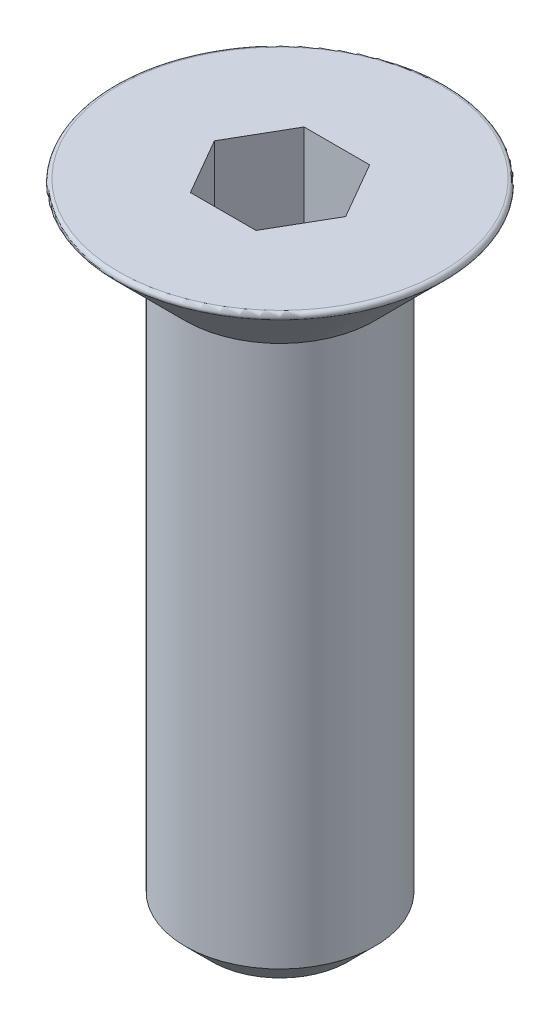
from build123d import *

# Parameters (mm, degrees)
CONG_1_R                = 0.1
CHANFREIN1_SIZE         = 0.7
ENL_V_MAT_EXTRU_1_DEPTH = 3


with BuildPart() as part:
    # Esquisse1 → R_volution1 (revolve)
    with BuildSketch(Plane.XY, mode=Mode.PRIVATE) as r_volution1_sk:
        Polygon((0, 0), (-4.5, 0), (-2.5, -2), (-2.5, -17), (0, -17), align=None)
    revolve(r_volution1_sk.sketch.rotate(Axis((0, 15.487971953, 0), (0, -1, 0)), 270), axis=Axis((0, 15.487971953, 0), (0, -1, 0)))

    # Cong_1
    cong_1_edges = [part.edges().sort_by_distance(p)[0] for p in [
        (0, 0, -4.5),
    ]]
    fillet(cong_1_edges, radius=CONG_1_R)

    # Chanfrein1
    chanfrein1_edges = [part.edges().sort_by_distance(p)[0] for p in [
        (0, -17, -2.5),
    ]]
    chamfer(chanfrein1_edges, length=CHANFREIN1_SIZE)

    # Esquisse2 → Enl_v. mat.-Extru.1 (cut)
    with BuildSketch(Plane(origin=(0, 0, 0), x_dir=(1, 0, 0), z_dir=(0, 1, 0))):
        Polygon((1.732050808, 0), (0.866025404, 1.5), (-0.866025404, 1.5), (-1.732050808, 0), (-0.866025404, -1.5), (0.866025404, -1.5), align=None)
    extrude(amount=-ENL_V_MAT_EXTRU_1_DEPTH, mode=Mode.SUBTRACT)


solid = part.part
